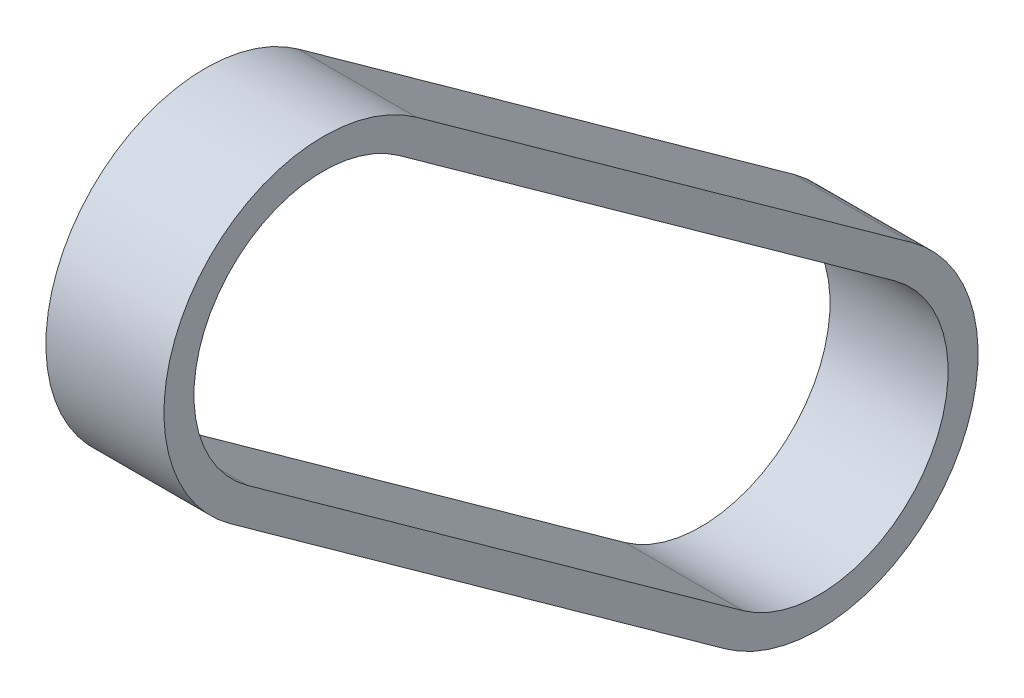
ISO-10303-21;
HEADER;
FILE_DESCRIPTION(('STEP AP214'),'2;1');
FILE_NAME('part.step','',(''),(''),'','','');
FILE_SCHEMA(('AUTOMOTIVE_DESIGN { 1 0 10303 214 1 1 1 1 }'));
ENDSEC;
DATA;
#1=APPLICATION_CONTEXT('core data for automotive mechanical design processes');
#2=APPLICATION_PROTOCOL_DEFINITION('international standard','automotive_design',2000,#1);
#3=PRODUCT_CONTEXT('',#1,'mechanical');
#4=PRODUCT('Part','Part','',(#3));
#5=PRODUCT_RELATED_PRODUCT_CATEGORY('part','',(#4));
#6=PRODUCT_DEFINITION_FORMATION('','',#4);
#7=PRODUCT_DEFINITION_CONTEXT('part definition',#1,'design');
#8=PRODUCT_DEFINITION('design','',#6,#7);
#9=PRODUCT_DEFINITION_SHAPE('','',#8);
#10=(LENGTH_UNIT() NAMED_UNIT(*) SI_UNIT(.MILLI.,.METRE.));
#11=(NAMED_UNIT(*) PLANE_ANGLE_UNIT() SI_UNIT($,.RADIAN.));
#12=(NAMED_UNIT(*) SI_UNIT($,.STERADIAN.) SOLID_ANGLE_UNIT());
#13=UNCERTAINTY_MEASURE_WITH_UNIT(LENGTH_MEASURE(1.E-05),#10,'distance_accuracy_value','');
#14=(GEOMETRIC_REPRESENTATION_CONTEXT(3) GLOBAL_UNCERTAINTY_ASSIGNED_CONTEXT((#13)) GLOBAL_UNIT_ASSIGNED_CONTEXT((#10,
#11,#12)) REPRESENTATION_CONTEXT('',''));
#15=CARTESIAN_POINT('',(0.,0.,0.));
#16=DIRECTION('',(0.,0.,1.));
#17=DIRECTION('',(1.,0.,0.));
#18=AXIS2_PLACEMENT_3D('',#15,#16,#17);
#19=CARTESIAN_POINT('',(-233.8,-295.32520409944,165.1));
#20=DIRECTION('',(-1.,0.,0.));
#21=DIRECTION('',(0.,0.,1.));
#22=AXIS2_PLACEMENT_3D('',#19,#20,#21);
#23=PLANE('',#22);
#24=DIRECTION('',(0.,-0.583734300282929,-0.811944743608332));
#25=VECTOR('',#24,1.);
#26=CARTESIAN_POINT('',(-233.8,-259.350011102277,186.961445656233));
#27=LINE('',#26,#25);
#28=CARTESIAN_POINT('',(-233.8,-236.730166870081,218.424499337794));
#29=VERTEX_POINT('',#28);
#30=CARTESIAN_POINT('',(-233.8,-281.969855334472,155.498391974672));
#31=VERTEX_POINT('',#30);
#32=EDGE_CURVE('E126',#29,#31,#27,.T.);
#33=ORIENTED_EDGE('',*,*,#32,.T.);
#34=CARTESIAN_POINT('',(-233.8,-295.32520409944,165.1));
#35=DIRECTION('',(-1.,0.,0.));
#36=DIRECTION('',(0.,0.811944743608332,-0.583734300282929));
#37=AXIS2_PLACEMENT_3D('',#34,#35,#36);
#38=CIRCLE('',#37,16.4485931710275);
#39=CARTESIAN_POINT('',(-233.8,-308.680552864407,174.701608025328));
#40=VERTEX_POINT('',#39);
#41=EDGE_CURVE('E27',#31,#40,#38,.T.);
#42=ORIENTED_EDGE('',*,*,#41,.T.);
#43=DIRECTION('',(0.,0.583734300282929,0.811944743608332));
#44=VECTOR('',#43,1.);
#45=CARTESIAN_POINT('',(-233.8,-286.060708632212,206.164661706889));
#46=LINE('',#45,#44);
#47=CARTESIAN_POINT('',(-233.8,-263.440864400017,237.627715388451));
#48=VERTEX_POINT('',#47);
#49=EDGE_CURVE('E167',#40,#48,#46,.T.);
#50=ORIENTED_EDGE('',*,*,#49,.T.);
#51=CARTESIAN_POINT('',(-233.8,-250.085515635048,228.026107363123));
#52=DIRECTION('',(-1.,0.,0.));
#53=DIRECTION('',(0.,-0.811944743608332,0.583734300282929));
#54=AXIS2_PLACEMENT_3D('',#51,#52,#53);
#55=CIRCLE('',#54,16.4485931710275);
#56=EDGE_CURVE('E107',#48,#29,#55,.T.);
#57=ORIENTED_EDGE('',*,*,#56,.T.);
#58=EDGE_LOOP('',(#33,#42,#50,#57));
#59=FACE_BOUND('',#58,.T.);
#60=DIRECTION('',(0.,-0.583734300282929,-0.811944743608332));
#61=VECTOR('',#60,1.);
#62=CARTESIAN_POINT('',(-233.8,-256.256501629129,184.737417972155));
#63=LINE('',#62,#61);
#64=CARTESIAN_POINT('',(-233.8,-233.636657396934,216.200471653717));
#65=VERTEX_POINT('',#64);
#66=CARTESIAN_POINT('',(-233.8,-278.876345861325,153.274364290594));
#67=VERTEX_POINT('',#66);
#68=EDGE_CURVE('E141',#65,#67,#63,.T.);
#69=ORIENTED_EDGE('',*,*,#68,.F.);
#70=CARTESIAN_POINT('',(-233.8,-250.085515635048,228.026107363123));
#71=DIRECTION('',(-1.,0.,0.));
#72=DIRECTION('',(0.,-0.811944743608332,0.583734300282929));
#73=AXIS2_PLACEMENT_3D('',#70,#71,#72);
#74=CIRCLE('',#73,20.2585931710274);
#75=CARTESIAN_POINT('',(-233.8,-266.534373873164,239.851743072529));
#76=VERTEX_POINT('',#75);
#77=EDGE_CURVE('E192',#76,#65,#74,.T.);
#78=ORIENTED_EDGE('',*,*,#77,.F.);
#79=DIRECTION('',(0.,0.583734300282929,0.811944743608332));
#80=VECTOR('',#79,1.);
#81=CARTESIAN_POINT('',(-233.8,-289.15421810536,208.388689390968));
#82=LINE('',#81,#80);
#83=CARTESIAN_POINT('',(-233.800000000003,-311.774062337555,176.925635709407));
#84=VERTEX_POINT('',#83);
#85=EDGE_CURVE('E152',#84,#76,#82,.T.);
#86=ORIENTED_EDGE('',*,*,#85,.F.);
#87=CARTESIAN_POINT('',(-233.8,-295.32520409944,165.1));
#88=DIRECTION('',(-1.,0.,0.));
#89=DIRECTION('',(0.,0.811944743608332,-0.583734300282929));
#90=AXIS2_PLACEMENT_3D('',#87,#88,#89);
#91=CIRCLE('',#90,20.2585931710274);
#92=EDGE_CURVE('E172',#67,#84,#91,.T.);
#93=ORIENTED_EDGE('',*,*,#92,.F.);
#94=EDGE_LOOP('',(#69,#78,#86,#93));
#95=FACE_BOUND('',#94,.T.);
#96=ADVANCED_FACE('F17',(#59,#95),#23,.F.);
#97=CARTESIAN_POINT('',(-248.8,-295.32520409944,165.1));
#98=DIRECTION('',(-1.,0.,0.));
#99=DIRECTION('',(0.,0.,1.));
#100=AXIS2_PLACEMENT_3D('',#97,#98,#99);
#101=PLANE('',#100);
#102=DIRECTION('',(0.,-0.583734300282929,-0.811944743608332));
#103=VECTOR('',#102,1.);
#104=CARTESIAN_POINT('',(-248.8,-259.350011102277,186.961445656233));
#105=LINE('',#104,#103);
#106=CARTESIAN_POINT('',(-248.8,-236.730166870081,218.424499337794));
#107=VERTEX_POINT('',#106);
#108=CARTESIAN_POINT('',(-248.8,-281.969855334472,155.498391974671));
#109=VERTEX_POINT('',#108);
#110=EDGE_CURVE('E128',#107,#109,#105,.T.);
#111=ORIENTED_EDGE('',*,*,#110,.F.);
#112=CARTESIAN_POINT('',(-248.8,-250.085515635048,228.026107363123));
#113=DIRECTION('',(-1.,0.,0.));
#114=DIRECTION('',(0.,-0.811944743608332,0.583734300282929));
#115=AXIS2_PLACEMENT_3D('',#112,#113,#114);
#116=CIRCLE('',#115,16.4485931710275);
#117=CARTESIAN_POINT('',(-248.8,-263.440864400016,237.627715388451));
#118=VERTEX_POINT('',#117);
#119=EDGE_CURVE('E160',#118,#107,#116,.T.);
#120=ORIENTED_EDGE('',*,*,#119,.F.);
#121=DIRECTION('',(0.,0.583734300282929,0.811944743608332));
#122=VECTOR('',#121,1.);
#123=CARTESIAN_POINT('',(-248.8,-286.060708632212,206.164661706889));
#124=LINE('',#123,#122);
#125=CARTESIAN_POINT('',(-248.8,-308.680552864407,174.701608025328));
#126=VERTEX_POINT('',#125);
#127=EDGE_CURVE('E146',#126,#118,#124,.T.);
#128=ORIENTED_EDGE('',*,*,#127,.F.);
#129=CARTESIAN_POINT('',(-248.8,-295.32520409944,165.1));
#130=DIRECTION('',(-1.,0.,0.));
#131=DIRECTION('',(0.,0.811944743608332,-0.583734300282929));
#132=AXIS2_PLACEMENT_3D('',#129,#130,#131);
#133=CIRCLE('',#132,16.4485931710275);
#134=EDGE_CURVE('E11',#109,#126,#133,.T.);
#135=ORIENTED_EDGE('',*,*,#134,.F.);
#136=EDGE_LOOP('',(#111,#120,#128,#135));
#137=FACE_BOUND('',#136,.T.);
#138=DIRECTION('',(0.,-0.583734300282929,-0.811944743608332));
#139=VECTOR('',#138,1.);
#140=CARTESIAN_POINT('',(-248.8,-256.256501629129,184.737417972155));
#141=LINE('',#140,#139);
#142=CARTESIAN_POINT('',(-248.8,-233.636657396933,216.200471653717));
#143=VERTEX_POINT('',#142);
#144=CARTESIAN_POINT('',(-248.8,-278.876345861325,153.274364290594));
#145=VERTEX_POINT('',#144);
#146=EDGE_CURVE('E161',#143,#145,#141,.T.);
#147=ORIENTED_EDGE('',*,*,#146,.T.);
#148=CARTESIAN_POINT('',(-248.8,-295.32520409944,165.1));
#149=DIRECTION('',(-1.,0.,0.));
#150=DIRECTION('',(0.,0.811944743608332,-0.583734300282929));
#151=AXIS2_PLACEMENT_3D('',#148,#149,#150);
#152=CIRCLE('',#151,20.2585931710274);
#153=CARTESIAN_POINT('',(-248.8,-311.774062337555,176.925635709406));
#154=VERTEX_POINT('',#153);
#155=EDGE_CURVE('E92',#145,#154,#152,.T.);
#156=ORIENTED_EDGE('',*,*,#155,.T.);
#157=DIRECTION('',(0.,0.583734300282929,0.811944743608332));
#158=VECTOR('',#157,1.);
#159=CARTESIAN_POINT('',(-248.8,-289.15421810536,208.388689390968));
#160=LINE('',#159,#158);
#161=CARTESIAN_POINT('',(-248.8,-266.534373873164,239.851743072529));
#162=VERTEX_POINT('',#161);
#163=EDGE_CURVE('E189',#154,#162,#160,.T.);
#164=ORIENTED_EDGE('',*,*,#163,.T.);
#165=CARTESIAN_POINT('',(-248.8,-250.085515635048,228.026107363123));
#166=DIRECTION('',(-1.,0.,0.));
#167=DIRECTION('',(0.,-0.811944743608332,0.583734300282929));
#168=AXIS2_PLACEMENT_3D('',#165,#166,#167);
#169=CIRCLE('',#168,20.2585931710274);
#170=EDGE_CURVE('E40',#162,#143,#169,.T.);
#171=ORIENTED_EDGE('',*,*,#170,.T.);
#172=EDGE_LOOP('',(#147,#156,#164,#171));
#173=FACE_BOUND('',#172,.T.);
#174=ADVANCED_FACE('F19',(#137,#173),#101,.T.);
#175=CARTESIAN_POINT('',(-248.8,-295.32520409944,165.1));
#176=DIRECTION('',(1.,0.,0.));
#177=DIRECTION('',(0.,1.,0.));
#178=AXIS2_PLACEMENT_3D('',#175,#176,#177);
#179=CYLINDRICAL_SURFACE('',#178,16.4485931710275);
#180=ORIENTED_EDGE('',*,*,#41,.F.);
#181=DIRECTION('',(1.,0.,0.));
#182=VECTOR('',#181,1.);
#183=CARTESIAN_POINT('',(-248.8,-281.969855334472,155.498391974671));
#184=LINE('',#183,#182);
#185=EDGE_CURVE('E116',#109,#31,#184,.T.);
#186=ORIENTED_EDGE('',*,*,#185,.F.);
#187=ORIENTED_EDGE('',*,*,#134,.T.);
#188=DIRECTION('',(1.,0.,0.));
#189=VECTOR('',#188,1.);
#190=CARTESIAN_POINT('',(-248.8,-308.680552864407,174.701608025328));
#191=LINE('',#190,#189);
#192=EDGE_CURVE('E119',#126,#40,#191,.T.);
#193=ORIENTED_EDGE('',*,*,#192,.T.);
#194=EDGE_LOOP('',(#180,#186,#187,#193));
#195=FACE_BOUND('',#194,.T.);
#196=ADVANCED_FACE('F115',(#195),#179,.F.);
#197=CARTESIAN_POINT('',(-248.8,-250.085515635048,228.026107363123));
#198=DIRECTION('',(1.,0.,0.));
#199=DIRECTION('',(0.,1.,0.));
#200=AXIS2_PLACEMENT_3D('',#197,#198,#199);
#201=CYLINDRICAL_SURFACE('',#200,20.2585931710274);
#202=ORIENTED_EDGE('',*,*,#77,.T.);
#203=DIRECTION('',(1.,0.,0.));
#204=VECTOR('',#203,1.);
#205=CARTESIAN_POINT('',(-248.8,-233.636657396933,216.200471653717));
#206=LINE('',#205,#204);
#207=EDGE_CURVE('E164',#143,#65,#206,.T.);
#208=ORIENTED_EDGE('',*,*,#207,.F.);
#209=ORIENTED_EDGE('',*,*,#170,.F.);
#210=DIRECTION('',(1.,0.,0.));
#211=VECTOR('',#210,1.);
#212=CARTESIAN_POINT('',(-248.8,-266.534373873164,239.851743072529));
#213=LINE('',#212,#211);
#214=EDGE_CURVE('E156',#162,#76,#213,.T.);
#215=ORIENTED_EDGE('',*,*,#214,.T.);
#216=EDGE_LOOP('',(#202,#208,#209,#215));
#217=FACE_BOUND('',#216,.T.);
#218=ADVANCED_FACE('F225',(#217),#201,.T.);
#219=CARTESIAN_POINT('',(-248.8,-289.15421810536,208.388689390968));
#220=DIRECTION('',(0.,0.811944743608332,-0.583734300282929));
#221=DIRECTION('',(-1.,0.,0.));
#222=AXIS2_PLACEMENT_3D('',#219,#220,#221);
#223=PLANE('',#222);
#224=ORIENTED_EDGE('',*,*,#85,.T.);
#225=ORIENTED_EDGE('',*,*,#214,.F.);
#226=ORIENTED_EDGE('',*,*,#163,.F.);
#227=DIRECTION('',(1.,0.,0.));
#228=VECTOR('',#227,1.);
#229=CARTESIAN_POINT('',(-248.8,-311.774062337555,176.925635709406));
#230=LINE('',#229,#228);
#231=EDGE_CURVE('E168',#154,#84,#230,.T.);
#232=ORIENTED_EDGE('',*,*,#231,.T.);
#233=EDGE_LOOP('',(#224,#225,#226,#232));
#234=FACE_BOUND('',#233,.T.);
#235=ADVANCED_FACE('F220',(#234),#223,.F.);
#236=CARTESIAN_POINT('',(-248.8,-295.32520409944,165.1));
#237=DIRECTION('',(1.,0.,0.));
#238=DIRECTION('',(0.,1.,0.));
#239=AXIS2_PLACEMENT_3D('',#236,#237,#238);
#240=CYLINDRICAL_SURFACE('',#239,20.2585931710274);
#241=ORIENTED_EDGE('',*,*,#92,.T.);
#242=ORIENTED_EDGE('',*,*,#231,.F.);
#243=ORIENTED_EDGE('',*,*,#155,.F.);
#244=DIRECTION('',(1.,0.,0.));
#245=VECTOR('',#244,1.);
#246=CARTESIAN_POINT('',(-248.8,-278.876345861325,153.274364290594));
#247=LINE('',#246,#245);
#248=EDGE_CURVE('E145',#145,#67,#247,.T.);
#249=ORIENTED_EDGE('',*,*,#248,.T.);
#250=EDGE_LOOP('',(#241,#242,#243,#249));
#251=FACE_BOUND('',#250,.T.);
#252=ADVANCED_FACE('F224',(#251),#240,.T.);
#253=CARTESIAN_POINT('',(-248.8,-256.256501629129,184.737417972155));
#254=DIRECTION('',(0.,-0.811944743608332,0.583734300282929));
#255=DIRECTION('',(-1.,0.,0.));
#256=AXIS2_PLACEMENT_3D('',#253,#254,#255);
#257=PLANE('',#256);
#258=ORIENTED_EDGE('',*,*,#68,.T.);
#259=ORIENTED_EDGE('',*,*,#248,.F.);
#260=ORIENTED_EDGE('',*,*,#146,.F.);
#261=ORIENTED_EDGE('',*,*,#207,.T.);
#262=EDGE_LOOP('',(#258,#259,#260,#261));
#263=FACE_BOUND('',#262,.T.);
#264=ADVANCED_FACE('F233',(#263),#257,.F.);
#265=CARTESIAN_POINT('',(-248.8,-286.060708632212,206.164661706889));
#266=DIRECTION('',(0.,0.811944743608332,-0.583734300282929));
#267=DIRECTION('',(-1.,0.,0.));
#268=AXIS2_PLACEMENT_3D('',#265,#266,#267);
#269=PLANE('',#268);
#270=ORIENTED_EDGE('',*,*,#49,.F.);
#271=ORIENTED_EDGE('',*,*,#192,.F.);
#272=ORIENTED_EDGE('',*,*,#127,.T.);
#273=DIRECTION('',(1.,0.,0.));
#274=VECTOR('',#273,1.);
#275=CARTESIAN_POINT('',(-248.8,-263.440864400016,237.627715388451));
#276=LINE('',#275,#274);
#277=EDGE_CURVE('E149',#118,#48,#276,.T.);
#278=ORIENTED_EDGE('',*,*,#277,.T.);
#279=EDGE_LOOP('',(#270,#271,#272,#278));
#280=FACE_BOUND('',#279,.T.);
#281=ADVANCED_FACE('F215',(#280),#269,.T.);
#282=CARTESIAN_POINT('',(-248.8,-250.085515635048,228.026107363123));
#283=DIRECTION('',(1.,0.,0.));
#284=DIRECTION('',(0.,1.,0.));
#285=AXIS2_PLACEMENT_3D('',#282,#283,#284);
#286=CYLINDRICAL_SURFACE('',#285,16.4485931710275);
#287=ORIENTED_EDGE('',*,*,#56,.F.);
#288=ORIENTED_EDGE('',*,*,#277,.F.);
#289=ORIENTED_EDGE('',*,*,#119,.T.);
#290=DIRECTION('',(1.,0.,0.));
#291=VECTOR('',#290,1.);
#292=CARTESIAN_POINT('',(-248.8,-236.730166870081,218.424499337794));
#293=LINE('',#292,#291);
#294=EDGE_CURVE('E133',#107,#29,#293,.T.);
#295=ORIENTED_EDGE('',*,*,#294,.T.);
#296=EDGE_LOOP('',(#287,#288,#289,#295));
#297=FACE_BOUND('',#296,.T.);
#298=ADVANCED_FACE('F207',(#297),#286,.F.);
#299=CARTESIAN_POINT('',(-248.8,-259.350011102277,186.961445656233));
#300=DIRECTION('',(0.,-0.811944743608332,0.583734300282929));
#301=DIRECTION('',(-1.,0.,0.));
#302=AXIS2_PLACEMENT_3D('',#299,#300,#301);
#303=PLANE('',#302);
#304=ORIENTED_EDGE('',*,*,#32,.F.);
#305=ORIENTED_EDGE('',*,*,#294,.F.);
#306=ORIENTED_EDGE('',*,*,#110,.T.);
#307=ORIENTED_EDGE('',*,*,#185,.T.);
#308=EDGE_LOOP('',(#304,#305,#306,#307));
#309=FACE_BOUND('',#308,.T.);
#310=ADVANCED_FACE('F124',(#309),#303,.T.);
#311=CLOSED_SHELL('',(#96,#174,#196,#218,#235,#252,#264,#281,#298,#310));
#312=MANIFOLD_SOLID_BREP('B1',#311);
#313=ADVANCED_BREP_SHAPE_REPRESENTATION('',(#18,#312),#14);
#314=SHAPE_DEFINITION_REPRESENTATION(#9,#313);
ENDSEC;
END-ISO-10303-21;
